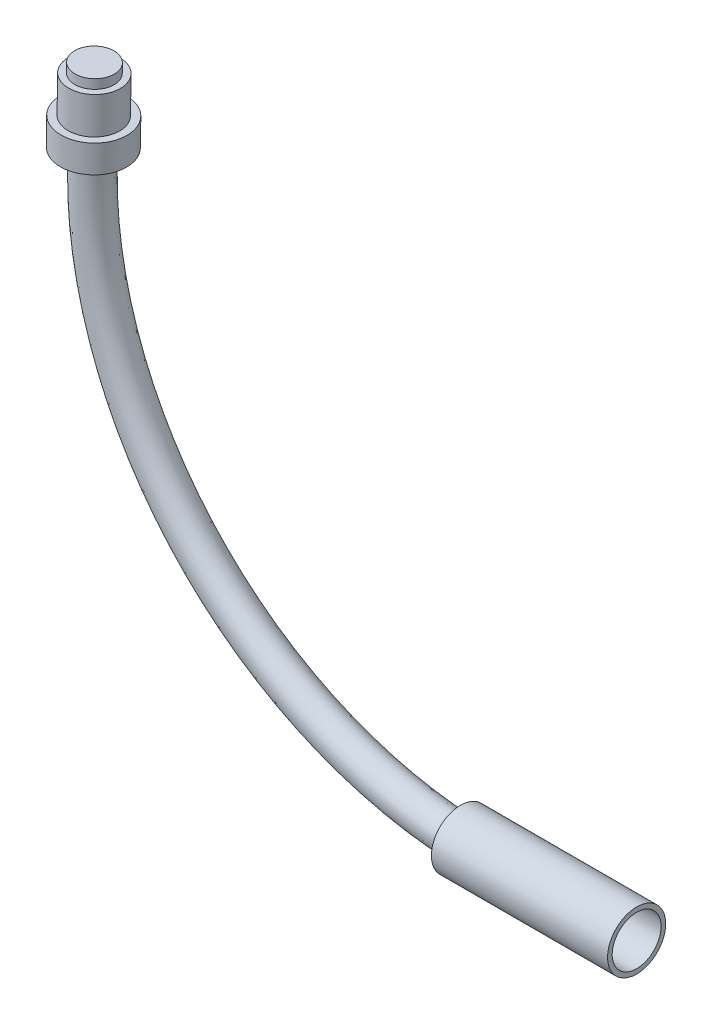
ISO-10303-21;
HEADER;
FILE_DESCRIPTION(('STEP AP214'),'2;1');
FILE_NAME('part.step','',(''),(''),'','','');
FILE_SCHEMA(('AUTOMOTIVE_DESIGN { 1 0 10303 214 1 1 1 1 }'));
ENDSEC;
DATA;
#1=APPLICATION_CONTEXT('core data for automotive mechanical design processes');
#2=APPLICATION_PROTOCOL_DEFINITION('international standard','automotive_design',2000,#1);
#3=PRODUCT_CONTEXT('',#1,'mechanical');
#4=PRODUCT('Part','Part','',(#3));
#5=PRODUCT_RELATED_PRODUCT_CATEGORY('part','',(#4));
#6=PRODUCT_DEFINITION_FORMATION('','',#4);
#7=PRODUCT_DEFINITION_CONTEXT('part definition',#1,'design');
#8=PRODUCT_DEFINITION('design','',#6,#7);
#9=PRODUCT_DEFINITION_SHAPE('','',#8);
#10=(LENGTH_UNIT() NAMED_UNIT(*) SI_UNIT(.MILLI.,.METRE.));
#11=(NAMED_UNIT(*) PLANE_ANGLE_UNIT() SI_UNIT($,.RADIAN.));
#12=(NAMED_UNIT(*) SI_UNIT($,.STERADIAN.) SOLID_ANGLE_UNIT());
#13=UNCERTAINTY_MEASURE_WITH_UNIT(LENGTH_MEASURE(1.E-05),#10,'distance_accuracy_value','');
#14=(GEOMETRIC_REPRESENTATION_CONTEXT(3) GLOBAL_UNCERTAINTY_ASSIGNED_CONTEXT((#13)) GLOBAL_UNIT_ASSIGNED_CONTEXT((#10,
#11,#12)) REPRESENTATION_CONTEXT('',''));
#15=CARTESIAN_POINT('',(0.,0.,0.));
#16=DIRECTION('',(0.,0.,1.));
#17=DIRECTION('',(1.,0.,0.));
#18=AXIS2_PLACEMENT_3D('',#15,#16,#17);
#19=CARTESIAN_POINT('',(-50.3085181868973,323.403177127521,-0.000182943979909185));
#20=DIRECTION('',(0.0161457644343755,0.999869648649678,0.));
#21=DIRECTION('',(-0.999869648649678,0.0161457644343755,0.));
#22=AXIS2_PLACEMENT_3D('',#19,#20,#21);
#23=PLANE('',#22);
#24=CARTESIAN_POINT('',(-50.3085181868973,323.403177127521,-0.000182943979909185));
#25=DIRECTION('',(0.0161457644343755,0.999869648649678,0.));
#26=DIRECTION('',(-0.999869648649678,0.0161457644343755,0.));
#27=AXIS2_PLACEMENT_3D('',#24,#25,#26);
#28=CIRCLE('',#27,2.6893471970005);
#29=CARTESIAN_POINT('',(-52.9975148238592,323.446598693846,-0.000182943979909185));
#30=VERTEX_POINT('',#29);
#31=EDGE_CURVE('E56',#30,#30,#28,.T.);
#32=ORIENTED_EDGE('',*,*,#31,.T.);
#33=EDGE_LOOP('',(#32));
#34=FACE_BOUND('',#33,.T.);
#35=CARTESIAN_POINT('',(-50.3085181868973,323.403177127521,-0.000182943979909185));
#36=DIRECTION('',(0.0161457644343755,0.999869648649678,0.));
#37=DIRECTION('',(-0.999869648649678,0.0161457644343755,0.));
#38=AXIS2_PLACEMENT_3D('',#35,#36,#37);
#39=CIRCLE('',#38,2.0447572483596);
#40=CARTESIAN_POINT('',(-52.3530088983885,323.436191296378,-0.000182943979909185));
#41=VERTEX_POINT('',#40);
#42=EDGE_CURVE('E65',#41,#41,#39,.T.);
#43=ORIENTED_EDGE('',*,*,#42,.F.);
#44=EDGE_LOOP('',(#43));
#45=FACE_BOUND('',#44,.T.);
#46=ADVANCED_FACE('F30',(#34,#45),#23,.T.);
#47=CARTESIAN_POINT('',(-50.3705179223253,319.563677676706,-0.000182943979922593));
#48=DIRECTION('',(0.0161457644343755,0.999869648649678,0.));
#49=DIRECTION('',(-0.999869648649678,0.0161457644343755,0.));
#50=AXIS2_PLACEMENT_3D('',#47,#48,#49);
#51=PLANE('',#50);
#52=CARTESIAN_POINT('',(-50.3705179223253,319.563677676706,-0.000182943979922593));
#53=DIRECTION('',(0.0161457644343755,0.999869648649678,0.));
#54=DIRECTION('',(-0.999869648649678,0.0161457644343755,0.));
#55=AXIS2_PLACEMENT_3D('',#52,#53,#54);
#56=CIRCLE('',#55,3.44746331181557);
#57=CARTESIAN_POINT('',(-53.817531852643,319.619339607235,-0.000182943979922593));
#58=VERTEX_POINT('',#57);
#59=EDGE_CURVE('E50',#58,#58,#56,.T.);
#60=ORIENTED_EDGE('',*,*,#59,.T.);
#61=EDGE_LOOP('',(#60));
#62=FACE_BOUND('',#61,.T.);
#63=CARTESIAN_POINT('',(-50.3705179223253,319.563677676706,-0.000182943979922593));
#64=DIRECTION('',(0.0161457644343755,0.999869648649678,0.));
#65=DIRECTION('',(-0.999869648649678,0.0161457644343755,0.));
#66=AXIS2_PLACEMENT_3D('',#63,#64,#65);
#67=CIRCLE('',#66,2.6893471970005);
#68=CARTESIAN_POINT('',(-53.0595145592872,319.607099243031,-0.000182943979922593));
#69=VERTEX_POINT('',#68);
#70=EDGE_CURVE('E59',#69,#69,#67,.T.);
#71=ORIENTED_EDGE('',*,*,#70,.F.);
#72=EDGE_LOOP('',(#71));
#73=FACE_BOUND('',#72,.T.);
#74=ADVANCED_FACE('F122',(#62,#73),#51,.T.);
#75=CARTESIAN_POINT('',(-50.4170177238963,316.684053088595,-0.000182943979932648));
#76=DIRECTION('',(-0.0161457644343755,-0.999869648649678,0.));
#77=DIRECTION('',(0.,0.,-1.));
#78=AXIS2_PLACEMENT_3D('',#75,#76,#77);
#79=CIRCLE('',#78,1.8170285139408);
#80=CARTESIAN_POINT('',(-10.2628615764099,313.889772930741,-0.000182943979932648));
#81=DIRECTION('',(0.,0.,1.));
#82=AXIS1_PLACEMENT('',#80,#81);
#83=SURFACE_OF_REVOLUTION('',#79,#82);
#84=CARTESIAN_POINT('',(-50.4170177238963,316.684053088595,-0.000182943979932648));
#85=DIRECTION('',(-0.0161457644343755,-0.999869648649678,0.));
#86=DIRECTION('',(0.,0.,-1.));
#87=AXIS2_PLACEMENT_3D('',#84,#85,#86);
#88=CIRCLE('',#87,1.8170285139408);
#89=CARTESIAN_POINT('',(-50.4170177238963,316.684053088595,-1.81721145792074));
#90=VERTEX_POINT('',#89);
#91=EDGE_CURVE('E47',#90,#90,#88,.T.);
#92=ORIENTED_EDGE('',*,*,#91,.T.);
#93=EDGE_LOOP('',(#92));
#94=FACE_BOUND('',#93,.T.);
#95=CARTESIAN_POINT('',(-12.4084579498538,273.695735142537,-0.000182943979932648));
#96=DIRECTION('',(1.,0.,0.));
#97=DIRECTION('',(0.,0.,-1.));
#98=AXIS2_PLACEMENT_3D('',#95,#96,#97);
#99=CIRCLE('',#98,1.8170285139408);
#100=CARTESIAN_POINT('',(-12.4084579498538,273.695735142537,-1.81721145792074));
#101=VERTEX_POINT('',#100);
#102=EDGE_CURVE('E10',#101,#101,#99,.T.);
#103=ORIENTED_EDGE('',*,*,#102,.F.);
#104=EDGE_LOOP('',(#103));
#105=FACE_BOUND('',#104,.T.);
#106=ADVANCED_FACE('F32',(#94,#105),#83,.F.);
#107=CARTESIAN_POINT('',(5.83154205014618,273.695735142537,-0.000182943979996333));
#108=DIRECTION('',(-1.,0.,0.));
#109=DIRECTION('',(0.,0.,1.));
#110=AXIS2_PLACEMENT_3D('',#107,#108,#109);
#111=CYLINDRICAL_SURFACE('',#110,3.01097120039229);
#112=CARTESIAN_POINT('',(5.83154205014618,273.695735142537,-0.000182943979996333));
#113=DIRECTION('',(1.,0.,0.));
#114=DIRECTION('',(0.,0.,-1.));
#115=AXIS2_PLACEMENT_3D('',#112,#113,#114);
#116=CIRCLE('',#115,3.01097120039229);
#117=CARTESIAN_POINT('',(5.83154205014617,273.695735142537,-3.01115414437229));
#118=VERTEX_POINT('',#117);
#119=EDGE_CURVE('E38',#118,#118,#116,.T.);
#120=ORIENTED_EDGE('',*,*,#119,.F.);
#121=EDGE_LOOP('',(#120));
#122=FACE_BOUND('',#121,.T.);
#123=CARTESIAN_POINT('',(-12.4084579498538,273.695735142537,-0.000182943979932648));
#124=DIRECTION('',(1.,0.,0.));
#125=DIRECTION('',(0.,0.,-1.));
#126=AXIS2_PLACEMENT_3D('',#123,#124,#125);
#127=CIRCLE('',#126,3.01097120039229);
#128=CARTESIAN_POINT('',(-12.4084579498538,273.695735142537,-3.01115414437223));
#129=VERTEX_POINT('',#128);
#130=EDGE_CURVE('E42',#129,#129,#127,.T.);
#131=ORIENTED_EDGE('',*,*,#130,.T.);
#132=EDGE_LOOP('',(#131));
#133=FACE_BOUND('',#132,.T.);
#134=ADVANCED_FACE('F152',(#122,#133),#111,.T.);
#135=CARTESIAN_POINT('',(5.83154205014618,273.695735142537,-0.000182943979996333));
#136=DIRECTION('',(1.,0.,0.));
#137=DIRECTION('',(0.,0.,-1.));
#138=AXIS2_PLACEMENT_3D('',#135,#136,#137);
#139=PLANE('',#138);
#140=CARTESIAN_POINT('',(5.83154205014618,273.695735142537,-0.000182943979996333));
#141=DIRECTION('',(1.,0.,0.));
#142=DIRECTION('',(0.,0.,-1.));
#143=AXIS2_PLACEMENT_3D('',#140,#141,#142);
#144=CIRCLE('',#143,2.53097120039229);
#145=CARTESIAN_POINT('',(5.83154205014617,273.695735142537,-2.53115414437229));
#146=VERTEX_POINT('',#145);
#147=EDGE_CURVE('E69',#146,#146,#144,.T.);
#148=ORIENTED_EDGE('',*,*,#147,.F.);
#149=EDGE_LOOP('',(#148));
#150=FACE_BOUND('',#149,.T.);
#151=ORIENTED_EDGE('',*,*,#119,.T.);
#152=EDGE_LOOP('',(#151));
#153=FACE_BOUND('',#152,.T.);
#154=ADVANCED_FACE('F150',(#150,#153),#139,.T.);
#155=CARTESIAN_POINT('',(-12.4084579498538,273.695735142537,-0.000182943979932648));
#156=DIRECTION('',(1.,0.,0.));
#157=DIRECTION('',(0.,0.,-1.));
#158=AXIS2_PLACEMENT_3D('',#155,#156,#157);
#159=PLANE('',#158);
#160=ORIENTED_EDGE('',*,*,#102,.T.);
#161=EDGE_LOOP('',(#160));
#162=FACE_BOUND('',#161,.T.);
#163=ORIENTED_EDGE('',*,*,#130,.F.);
#164=EDGE_LOOP('',(#163));
#165=FACE_BOUND('',#164,.T.);
#166=ADVANCED_FACE('F146',(#162,#165),#159,.F.);
#167=CARTESIAN_POINT('',(-50.3705179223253,319.563677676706,-0.000182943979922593));
#168=DIRECTION('',(-0.0161457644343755,-0.999869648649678,0.));
#169=DIRECTION('',(0.999869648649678,-0.0161457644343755,0.));
#170=AXIS2_PLACEMENT_3D('',#167,#168,#169);
#171=CYLINDRICAL_SURFACE('',#170,3.44746331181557);
#172=ORIENTED_EDGE('',*,*,#59,.F.);
#173=EDGE_LOOP('',(#172));
#174=FACE_BOUND('',#173,.T.);
#175=CARTESIAN_POINT('',(-50.4170177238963,316.684053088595,-0.000182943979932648));
#176=DIRECTION('',(0.0161457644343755,0.999869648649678,0.));
#177=DIRECTION('',(-0.999869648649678,0.0161457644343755,0.));
#178=AXIS2_PLACEMENT_3D('',#175,#176,#177);
#179=CIRCLE('',#178,3.44746331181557);
#180=CARTESIAN_POINT('',(-53.864031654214,316.739715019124,-0.000182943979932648));
#181=VERTEX_POINT('',#180);
#182=EDGE_CURVE('E53',#181,#181,#179,.T.);
#183=ORIENTED_EDGE('',*,*,#182,.T.);
#184=EDGE_LOOP('',(#183));
#185=FACE_BOUND('',#184,.T.);
#186=ADVANCED_FACE('F141',(#174,#185),#171,.T.);
#187=CARTESIAN_POINT('',(-50.4170177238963,316.684053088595,-0.000182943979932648));
#188=DIRECTION('',(0.0161457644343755,0.999869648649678,0.));
#189=DIRECTION('',(-0.999869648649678,0.0161457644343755,0.));
#190=AXIS2_PLACEMENT_3D('',#187,#188,#189);
#191=PLANE('',#190);
#192=ORIENTED_EDGE('',*,*,#91,.F.);
#193=EDGE_LOOP('',(#192));
#194=FACE_BOUND('',#193,.T.);
#195=ORIENTED_EDGE('',*,*,#182,.F.);
#196=EDGE_LOOP('',(#195));
#197=FACE_BOUND('',#196,.T.);
#198=ADVANCED_FACE('F138',(#194,#197),#191,.F.);
#199=CARTESIAN_POINT('',(-50.3085181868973,323.403177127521,-0.000182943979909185));
#200=DIRECTION('',(-0.0161457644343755,-0.999869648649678,0.));
#201=DIRECTION('',(0.999869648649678,-0.0161457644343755,0.));
#202=AXIS2_PLACEMENT_3D('',#199,#200,#201);
#203=CYLINDRICAL_SURFACE('',#202,2.6893471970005);
#204=ORIENTED_EDGE('',*,*,#31,.F.);
#205=EDGE_LOOP('',(#204));
#206=FACE_BOUND('',#205,.T.);
#207=ORIENTED_EDGE('',*,*,#70,.T.);
#208=EDGE_LOOP('',(#207));
#209=FACE_BOUND('',#208,.T.);
#210=ADVANCED_FACE('F135',(#206,#209),#203,.T.);
#211=CARTESIAN_POINT('',(-50.2930182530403,324.363051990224,-0.000182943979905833));
#212=DIRECTION('',(-0.0161457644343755,-0.999869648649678,0.));
#213=DIRECTION('',(0.999869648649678,-0.0161457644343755,0.));
#214=AXIS2_PLACEMENT_3D('',#211,#212,#213);
#215=CYLINDRICAL_SURFACE('',#214,2.0447572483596);
#216=CARTESIAN_POINT('',(-50.2930182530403,324.363051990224,-0.000182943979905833));
#217=DIRECTION('',(0.0161457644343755,0.999869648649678,0.));
#218=DIRECTION('',(-0.999869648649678,0.0161457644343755,0.));
#219=AXIS2_PLACEMENT_3D('',#216,#217,#218);
#220=CIRCLE('',#219,2.0447572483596);
#221=CARTESIAN_POINT('',(-52.3375089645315,324.396066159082,-0.000182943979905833));
#222=VERTEX_POINT('',#221);
#223=EDGE_CURVE('E62',#222,#222,#220,.T.);
#224=ORIENTED_EDGE('',*,*,#223,.F.);
#225=EDGE_LOOP('',(#224));
#226=FACE_BOUND('',#225,.T.);
#227=ORIENTED_EDGE('',*,*,#42,.T.);
#228=EDGE_LOOP('',(#227));
#229=FACE_BOUND('',#228,.T.);
#230=ADVANCED_FACE('F133',(#226,#229),#215,.T.);
#231=CARTESIAN_POINT('',(-50.2930182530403,324.363051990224,-0.000182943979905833));
#232=DIRECTION('',(0.0161457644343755,0.999869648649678,0.));
#233=DIRECTION('',(-0.999869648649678,0.0161457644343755,0.));
#234=AXIS2_PLACEMENT_3D('',#231,#232,#233);
#235=PLANE('',#234);
#236=ORIENTED_EDGE('',*,*,#223,.T.);
#237=EDGE_LOOP('',(#236));
#238=FACE_BOUND('',#237,.T.);
#239=ADVANCED_FACE('F195',(#238),#235,.T.);
#240=CARTESIAN_POINT('',(-50.3162681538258,322.923239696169,-0.000182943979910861));
#241=DIRECTION('',(0.0161457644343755,0.999869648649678,0.));
#242=DIRECTION('',(-0.999869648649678,0.0161457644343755,0.));
#243=AXIS2_PLACEMENT_3D('',#240,#241,#242);
#244=PLANE('',#243);
#245=CARTESIAN_POINT('',(-50.3162681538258,322.923239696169,-0.000182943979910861));
#246=DIRECTION('',(0.0161457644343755,0.999869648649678,0.));
#247=DIRECTION('',(-0.999869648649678,0.0161457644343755,0.));
#248=AXIS2_PLACEMENT_3D('',#245,#246,#247);
#249=CIRCLE('',#248,2.2093471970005);
#250=CARTESIAN_POINT('',(-52.5253273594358,322.958911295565,-0.000182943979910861));
#251=VERTEX_POINT('',#250);
#252=EDGE_CURVE('E282',#251,#251,#249,.T.);
#253=ORIENTED_EDGE('',*,*,#252,.F.);
#254=EDGE_LOOP('',(#253));
#255=FACE_BOUND('',#254,.T.);
#256=CARTESIAN_POINT('',(-50.3162681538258,322.923239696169,-0.000182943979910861));
#257=DIRECTION('',(0.0161457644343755,0.999869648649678,0.));
#258=DIRECTION('',(-0.999869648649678,0.0161457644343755,0.));
#259=AXIS2_PLACEMENT_3D('',#256,#257,#258);
#260=CIRCLE('',#259,1.5647572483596);
#261=CARTESIAN_POINT('',(-51.8808214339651,322.948503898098,-0.000182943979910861));
#262=VERTEX_POINT('',#261);
#263=EDGE_CURVE('E77',#262,#262,#260,.T.);
#264=ORIENTED_EDGE('',*,*,#263,.T.);
#265=EDGE_LOOP('',(#264));
#266=FACE_BOUND('',#265,.T.);
#267=ADVANCED_FACE('F203',(#255,#266),#244,.F.);
#268=CARTESIAN_POINT('',(-50.3782678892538,319.083740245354,-0.000182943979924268));
#269=DIRECTION('',(0.0161457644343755,0.999869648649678,0.));
#270=DIRECTION('',(-0.999869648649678,0.0161457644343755,0.));
#271=AXIS2_PLACEMENT_3D('',#268,#269,#270);
#272=PLANE('',#271);
#273=CARTESIAN_POINT('',(-50.3782678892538,319.083740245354,-0.000182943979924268));
#274=DIRECTION('',(0.0161457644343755,0.999869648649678,0.));
#275=DIRECTION('',(-0.999869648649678,0.0161457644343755,0.));
#276=AXIS2_PLACEMENT_3D('',#273,#274,#275);
#277=CIRCLE('',#276,2.96746331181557);
#278=CARTESIAN_POINT('',(-53.3453443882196,319.131652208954,-0.000182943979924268));
#279=VERTEX_POINT('',#278);
#280=EDGE_CURVE('E285',#279,#279,#277,.T.);
#281=ORIENTED_EDGE('',*,*,#280,.F.);
#282=EDGE_LOOP('',(#281));
#283=FACE_BOUND('',#282,.T.);
#284=CARTESIAN_POINT('',(-50.3782678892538,319.083740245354,-0.000182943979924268));
#285=DIRECTION('',(0.0161457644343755,0.999869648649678,0.));
#286=DIRECTION('',(-0.999869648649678,0.0161457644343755,0.));
#287=AXIS2_PLACEMENT_3D('',#284,#285,#286);
#288=CIRCLE('',#287,2.2093471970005);
#289=CARTESIAN_POINT('',(-52.5873270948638,319.119411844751,-0.000182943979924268));
#290=VERTEX_POINT('',#289);
#291=EDGE_CURVE('E76',#290,#290,#288,.T.);
#292=ORIENTED_EDGE('',*,*,#291,.T.);
#293=EDGE_LOOP('',(#292));
#294=FACE_BOUND('',#293,.T.);
#295=ADVANCED_FACE('F99',(#283,#294),#272,.F.);
#296=CARTESIAN_POINT('',(-50.4170177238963,316.684053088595,-0.000182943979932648));
#297=DIRECTION('',(-0.0161457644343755,-0.999869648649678,0.));
#298=DIRECTION('',(0.,0.,-1.));
#299=AXIS2_PLACEMENT_3D('',#296,#297,#298);
#300=CIRCLE('',#299,1.8170285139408);
#301=CARTESIAN_POINT('',(-10.2628615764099,313.889772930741,-0.000182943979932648));
#302=DIRECTION('',(0.,0.,1.));
#303=AXIS1_PLACEMENT('',#301,#302);
#304=SURFACE_OF_REVOLUTION('',#300,#303);
#305=OFFSET_SURFACE('',#304,0.48,.F.);
#306=CARTESIAN_POINT('',(-50.4017398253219,317.16386895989,1.3366811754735));
#307=CARTESIAN_POINT('',(-50.4768591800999,317.165081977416,1.33549800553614));
#308=CARTESIAN_POINT('',(-50.5519573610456,317.166294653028,1.32796339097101));
#309=CARTESIAN_POINT('',(-50.6627834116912,317.168084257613,1.30731394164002));
#310=CARTESIAN_POINT('',(-50.6994513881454,317.168676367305,1.29886202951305));
#311=CARTESIAN_POINT('',(-50.7719818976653,317.169847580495,1.27889376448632));
#312=CARTESIAN_POINT('',(-50.8078436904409,317.170426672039,1.26737471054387));
#313=CARTESIAN_POINT('',(-50.9136861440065,317.172135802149,1.22836513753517));
#314=CARTESIAN_POINT('',(-50.9820690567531,317.173240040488,1.19639499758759));
#315=CARTESIAN_POINT('',(-51.1124895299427,317.175346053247,1.12141132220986));
#316=CARTESIAN_POINT('',(-51.1745269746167,317.176347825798,1.07839758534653));
#317=CARTESIAN_POINT('',(-51.2614763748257,317.177751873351,1.00656697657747));
#318=CARTESIAN_POINT('',(-51.2894573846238,317.178203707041,0.981386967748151));
#319=CARTESIAN_POINT('',(-51.343174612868,317.179071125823,0.928786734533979));
#320=CARTESIAN_POINT('',(-51.368912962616,317.179486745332,0.901368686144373));
#321=CARTESIAN_POINT('',(-51.4425355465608,317.180675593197,0.815979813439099));
#322=CARTESIAN_POINT('',(-51.4868490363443,317.18139116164,0.754856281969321));
#323=CARTESIAN_POINT('',(-51.5645497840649,317.182645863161,0.626079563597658));
#324=CARTESIAN_POINT('',(-51.5979394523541,317.183185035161,0.558427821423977));
#325=CARTESIAN_POINT('',(-51.6528924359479,317.18407240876,0.418469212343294));
#326=CARTESIAN_POINT('',(-51.6744557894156,317.184420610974,0.346162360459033));
#327=CARTESIAN_POINT('',(-51.7051304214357,317.184915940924,0.198970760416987));
#328=CARTESIAN_POINT('',(-51.7142441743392,317.185063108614,0.124086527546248));
#329=CARTESIAN_POINT('',(-51.7197710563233,317.185152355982,-0.0261497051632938));
#330=CARTESIAN_POINT('',(-51.7161842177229,317.185094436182,-0.101501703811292));
#331=CARTESIAN_POINT('',(-51.6964122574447,317.184775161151,-0.250526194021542));
#332=CARTESIAN_POINT('',(-51.6802283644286,317.184513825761,-0.324198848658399));
#333=CARTESIAN_POINT('',(-51.635723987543,317.183795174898,-0.467781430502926));
#334=CARTESIAN_POINT('',(-51.6074034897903,317.183337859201,-0.53769135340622));
#335=CARTESIAN_POINT('',(-51.539428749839,317.182240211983,-0.671768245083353));
#336=CARTESIAN_POINT('',(-51.4997738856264,317.181599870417,-0.735934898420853));
#337=CARTESIAN_POINT('',(-51.4102575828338,317.180154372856,-0.856700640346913));
#338=CARTESIAN_POINT('',(-51.3603961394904,317.179349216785,-0.913299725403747));
#339=CARTESIAN_POINT('',(-51.2518726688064,317.177596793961,-1.01733475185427));
#340=CARTESIAN_POINT('',(-51.193209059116,317.176649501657,-1.06476904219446));
#341=CARTESIAN_POINT('',(-51.0687533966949,317.174639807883,-1.14911681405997));
#342=CARTESIAN_POINT('',(-51.0029613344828,317.173577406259,-1.18603028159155));
#343=CARTESIAN_POINT('',(-50.866101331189,317.171367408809,-1.24829665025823));
#344=CARTESIAN_POINT('',(-50.7950322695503,317.170219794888,-1.27364708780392));
#345=CARTESIAN_POINT('',(-50.6496477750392,317.167872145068,-1.31205704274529));
#346=CARTESIAN_POINT('',(-50.5753323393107,317.166672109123,-1.32511654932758));
#347=CARTESIAN_POINT('',(-50.4255533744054,317.164253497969,-1.33857522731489));
#348=CARTESIAN_POINT('',(-50.3500896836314,317.163034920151,-1.33897259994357));
#349=CARTESIAN_POINT('',(-50.2001666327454,317.160613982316,-1.32709095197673));
#350=CARTESIAN_POINT('',(-50.1257072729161,317.159411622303,-1.31481192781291));
#351=CARTESIAN_POINT('',(-49.9799059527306,317.157057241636,-1.27792526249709));
#352=CARTESIAN_POINT('',(-49.9085640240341,317.155905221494,-1.25331749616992));
#353=CARTESIAN_POINT('',(-49.7710242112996,317.15368424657,-1.19247106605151));
#354=CARTESIAN_POINT('',(-49.7048263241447,317.152615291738,-1.15623240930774));
#355=CARTESIAN_POINT('',(-49.5794619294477,317.150590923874,-1.07315696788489));
#356=CARTESIAN_POINT('',(-49.5202946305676,317.149635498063,-1.02632137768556));
#357=CARTESIAN_POINT('',(-49.4106635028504,317.147865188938,-0.923378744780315));
#358=CARTESIAN_POINT('',(-49.3601996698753,317.147050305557,-0.867271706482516));
#359=CARTESIAN_POINT('',(-49.2694172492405,317.145584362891,-0.747389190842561));
#360=CARTESIAN_POINT('',(-49.2290969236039,317.144933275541,-0.683615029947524));
#361=CARTESIAN_POINT('',(-49.1597358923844,317.143813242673,-0.550201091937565));
#362=CARTESIAN_POINT('',(-49.1306951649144,317.1433442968,-0.480561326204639));
#363=CARTESIAN_POINT('',(-49.0847223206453,317.142601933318,-0.337404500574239));
#364=CARTESIAN_POINT('',(-49.0677883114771,317.142328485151,-0.263888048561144));
#365=CARTESIAN_POINT('',(-49.0465021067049,317.141984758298,-0.115055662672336));
#366=CARTESIAN_POINT('',(-49.0421499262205,317.141914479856,-0.0397397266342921));
#367=CARTESIAN_POINT('',(-49.0461530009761,317.141979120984,0.110549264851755));
#368=CARTESIAN_POINT('',(-49.054507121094,317.142114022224,0.185522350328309));
#369=CARTESIAN_POINT('',(-49.0836756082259,317.142585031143,0.332993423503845));
#370=CARTESIAN_POINT('',(-49.104489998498,317.142921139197,0.405491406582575));
#371=CARTESIAN_POINT('',(-49.1580172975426,317.143785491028,0.545996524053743));
#372=CARTESIAN_POINT('',(-49.1907304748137,317.14431373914,0.614003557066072));
#373=CARTESIAN_POINT('',(-49.2479531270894,317.145237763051,0.711095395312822));
#374=CARTESIAN_POINT('',(-49.26839068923,317.145567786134,0.742644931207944));
#375=CARTESIAN_POINT('',(-49.3118667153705,317.146269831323,0.803944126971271));
#376=CARTESIAN_POINT('',(-49.3349076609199,317.146641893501,0.83369202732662));
#377=CARTESIAN_POINT('',(-49.407647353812,317.147816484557,0.919823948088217));
#378=CARTESIAN_POINT('',(-49.4610111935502,317.148678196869,0.973177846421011));
#379=CARTESIAN_POINT('',(-49.575944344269,317.150534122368,1.0701553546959));
#380=CARTESIAN_POINT('',(-49.6375135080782,317.15152833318,1.11377913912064));
#381=CARTESIAN_POINT('',(-49.7346786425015,317.153097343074,1.17100336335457));
#382=CARTESIAN_POINT('',(-49.7679063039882,317.15363389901,1.188723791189));
#383=CARTESIAN_POINT('',(-49.8357020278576,317.1547286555,1.22128879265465));
#384=CARTESIAN_POINT('',(-49.8702688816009,317.155286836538,1.23613589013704));
#385=CARTESIAN_POINT('',(-49.9756162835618,317.156987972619,1.27619453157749));
#386=CARTESIAN_POINT('',(-50.0481519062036,317.158159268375,1.296987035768));
#387=CARTESIAN_POINT('',(-50.1678953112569,317.160092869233,1.32062991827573));
#388=CARTESIAN_POINT('',(-50.2144010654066,317.160843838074,1.32728461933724));
#389=CARTESIAN_POINT('',(-50.3078539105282,317.162352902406,1.33567990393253));
#390=CARTESIAN_POINT('',(-50.3548010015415,317.163110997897,1.33742048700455));
#391=CARTESIAN_POINT('',(-50.4017398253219,317.16386895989,1.3366811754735));
#392=B_SPLINE_CURVE_WITH_KNOTS('',3,(#306,#307,#308,#309,#310,#311,#312,#313,#314,#315,#316,
#317,#318,#319,#320,#321,#322,#323,#324,#325,#326,#327,#328,#329,#330,#331,#332,#333,#334,#335,
#336,#337,#338,#339,#340,#341,#342,#343,#344,#345,#346,#347,#348,#349,#350,#351,#352,#353,#354,
#355,#356,#357,#358,#359,#360,#361,#362,#363,#364,#365,#366,#367,#368,#369,#370,#371,#372,#373,
#374,#375,#376,#377,#378,#379,#380,#381,#382,#383,#384,#385,#386,#387,#388,#389,#390,#391),
.UNSPECIFIED.,.T.,.F.,(4,2,2,2,2,2,2,2,2,2,2,2,2,2,2,2,2,2,2,2,2,2,2,2,2,2,2,2,2,2,2,2,2,2,2,2,
2,2,2,2,2,2,4),(0.,0.225214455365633,0.33800794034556,0.450901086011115,0.676249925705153,
0.901602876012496,1.01442133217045,1.12713137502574,1.35246793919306,1.57775474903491,
1.80304083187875,2.02828213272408,2.25352286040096,2.47874162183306,2.70396064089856,
2.92919202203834,3.15442350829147,3.37969553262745,3.60496785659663,3.83028815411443,
4.05560864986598,4.28096115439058,4.50631372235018,4.73166857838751,4.95702329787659,
5.18235262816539,5.40768185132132,5.63297244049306,5.85826259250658,6.08351752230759,
6.30877272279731,6.53400780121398,6.75924330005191,6.98448388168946,7.09714581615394,
7.20991606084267,7.43517567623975,7.6604312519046,7.77329604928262,7.88606125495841,
8.11121963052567,8.25194635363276,8.39267308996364),.UNSPECIFIED.);
#393=CARTESIAN_POINT('',(-50.4017398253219,317.16386895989,1.3366811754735));
#394=VERTEX_POINT('',#393);
#395=EDGE_CURVE('E80',#394,#394,#392,.T.);
#396=ORIENTED_EDGE('',*,*,#395,.F.);
#397=EDGE_LOOP('',(#396));
#398=FACE_BOUND('',#397,.T.);
#399=CARTESIAN_POINT('',(-11.9284579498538,273.689714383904,1.33674067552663));
#400=CARTESIAN_POINT('',(-11.9284579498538,273.614746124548,1.33767565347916));
#401=CARTESIAN_POINT('',(-11.9284579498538,273.539620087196,1.33227257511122));
#402=CARTESIAN_POINT('',(-11.9284579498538,273.428485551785,1.31479111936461));
#403=CARTESIAN_POINT('',(-11.9284579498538,273.391670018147,1.30739115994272));
#404=CARTESIAN_POINT('',(-11.9284579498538,273.31875652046,1.28951185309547));
#405=CARTESIAN_POINT('',(-11.9284579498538,273.28265921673,1.27902980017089));
#406=CARTESIAN_POINT('',(-11.9284579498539,273.175982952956,1.24309495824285));
#407=CARTESIAN_POINT('',(-11.9284579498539,273.106871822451,1.2131300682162));
#408=CARTESIAN_POINT('',(-11.9284579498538,272.974664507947,1.14201410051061));
#409=CARTESIAN_POINT('',(-11.9284579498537,272.911568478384,1.10086273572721));
#410=CARTESIAN_POINT('',(-11.9284579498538,272.822784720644,1.03166740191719));
#411=CARTESIAN_POINT('',(-11.9284579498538,272.794143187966,1.00733172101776));
#412=CARTESIAN_POINT('',(-11.9284579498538,272.739035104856,0.956363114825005));
#413=CARTESIAN_POINT('',(-11.9284579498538,272.712566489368,0.929732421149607));
#414=CARTESIAN_POINT('',(-11.9284579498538,272.636652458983,0.846613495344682));
#415=CARTESIAN_POINT('',(-11.9284579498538,272.590677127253,0.78688144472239));
#416=CARTESIAN_POINT('',(-11.9284579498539,272.509377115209,0.660525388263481));
#417=CARTESIAN_POINT('',(-11.9284579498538,272.474062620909,0.593894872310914));
#418=CARTESIAN_POINT('',(-11.9284579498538,272.415103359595,0.45564646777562));
#419=CARTESIAN_POINT('',(-11.9284579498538,272.391458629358,0.38402856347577));
#420=CARTESIAN_POINT('',(-11.9284579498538,272.356500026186,0.23778064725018));
#421=CARTESIAN_POINT('',(-11.9284579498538,272.345196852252,0.163148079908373));
#422=CARTESIAN_POINT('',(-11.9284579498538,272.335274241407,0.0130439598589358));
#423=CARTESIAN_POINT('',(-11.9284579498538,272.336654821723,-0.0624275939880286));
#424=CARTESIAN_POINT('',(-11.9284579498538,272.352064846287,-0.212100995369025));
#425=CARTESIAN_POINT('',(-11.9284579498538,272.366099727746,-0.28630228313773));
#426=CARTESIAN_POINT('',(-11.9284579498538,272.406429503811,-0.431295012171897));
#427=CARTESIAN_POINT('',(-11.9284579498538,272.432724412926,-0.502086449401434));
#428=CARTESIAN_POINT('',(-11.9284579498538,272.496825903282,-0.638236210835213));
#429=CARTESIAN_POINT('',(-11.9284579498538,272.53463062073,-0.703595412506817));
#430=CARTESIAN_POINT('',(-11.9284579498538,272.620683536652,-0.827033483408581));
#431=CARTESIAN_POINT('',(-11.9284579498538,272.668931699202,-0.885112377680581));
#432=CARTESIAN_POINT('',(-11.9284579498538,272.774467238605,-0.992296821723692));
#433=CARTESIAN_POINT('',(-11.9284579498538,272.8317483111,-1.04140857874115));
#434=CARTESIAN_POINT('',(-11.9284579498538,272.953749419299,-1.12930720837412));
#435=CARTESIAN_POINT('',(-11.9284579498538,273.018469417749,-1.16809413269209));
#436=CARTESIAN_POINT('',(-11.9284579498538,273.153443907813,-1.23420204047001));
#437=CARTESIAN_POINT('',(-11.9284579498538,273.223692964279,-1.26153412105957));
#438=CARTESIAN_POINT('',(-11.9284579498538,273.367785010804,-1.30400503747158));
#439=CARTESIAN_POINT('',(-11.9284579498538,273.441627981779,-1.31914393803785));
#440=CARTESIAN_POINT('',(-11.9284579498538,273.590743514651,-1.33678712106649));
#441=CARTESIAN_POINT('',(-11.9284579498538,273.666014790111,-1.33930227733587));
#442=CARTESIAN_POINT('',(-11.9284579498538,273.815910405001,-1.33165475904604));
#443=CARTESIAN_POINT('',(-11.9284579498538,273.890534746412,-1.32149212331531));
#444=CARTESIAN_POINT('',(-11.9284579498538,274.036989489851,-1.28878501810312));
#445=CARTESIAN_POINT('',(-11.9284579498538,274.108820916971,-1.26624513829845));
#446=CARTESIAN_POINT('',(-11.9284579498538,274.247681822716,-1.20942965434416));
#447=CARTESIAN_POINT('',(-11.9284579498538,274.314711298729,-1.17515404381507));
#448=CARTESIAN_POINT('',(-11.9284579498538,274.442091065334,-1.09583078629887));
#449=CARTESIAN_POINT('',(-11.9284579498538,274.502439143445,-1.05077958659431));
#450=CARTESIAN_POINT('',(-11.9284579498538,274.614724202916,-0.951193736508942));
#451=CARTESIAN_POINT('',(-11.9284579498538,274.666661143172,-0.896659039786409));
#452=CARTESIAN_POINT('',(-11.9284579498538,274.760702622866,-0.779600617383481));
#453=CARTESIAN_POINT('',(-11.9284579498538,274.802797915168,-0.717069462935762));
#454=CARTESIAN_POINT('',(-11.9284579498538,274.875906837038,-0.585833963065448));
#455=CARTESIAN_POINT('',(-11.9284579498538,274.906920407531,-0.517129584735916));
#456=CARTESIAN_POINT('',(-11.9284579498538,274.957021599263,-0.375414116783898));
#457=CARTESIAN_POINT('',(-11.9284579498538,274.976095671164,-0.302398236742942));
#458=CARTESIAN_POINT('',(-11.9284579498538,275.00172600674,-0.154201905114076));
#459=CARTESIAN_POINT('',(-11.9284579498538,275.008282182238,-0.0790214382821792));
#460=CARTESIAN_POINT('',(-11.9284579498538,275.008690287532,0.0714354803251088));
#461=CARTESIAN_POINT('',(-11.9284579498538,275.002532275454,0.146711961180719));
#462=CARTESIAN_POINT('',(-11.9284579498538,274.977672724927,0.295154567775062));
#463=CARTESIAN_POINT('',(-11.9284579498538,274.958971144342,0.368320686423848));
#464=CARTESIAN_POINT('',(-11.9284579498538,274.909522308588,0.510509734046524));
#465=CARTESIAN_POINT('',(-11.9284579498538,274.878774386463,0.579532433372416));
#466=CARTESIAN_POINT('',(-11.9284579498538,274.824340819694,0.678378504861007));
#467=CARTESIAN_POINT('',(-11.9284579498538,274.804806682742,0.710551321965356));
#468=CARTESIAN_POINT('',(-11.9284579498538,274.763079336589,0.773169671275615));
#469=CARTESIAN_POINT('',(-11.9284579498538,274.740883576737,0.8036135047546));
#470=CARTESIAN_POINT('',(-11.9284579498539,274.670618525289,0.891882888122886));
#471=CARTESIAN_POINT('',(-11.9284579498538,274.618795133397,0.94678459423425));
#472=CARTESIAN_POINT('',(-11.9284579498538,274.506649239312,1.04708172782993));
#473=CARTESIAN_POINT('',(-11.9284579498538,274.446326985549,1.09247743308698));
#474=CARTESIAN_POINT('',(-11.9284579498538,274.350827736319,1.15245538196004));
#475=CARTESIAN_POINT('',(-11.9284579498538,274.318144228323,1.17110141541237));
#476=CARTESIAN_POINT('',(-11.9284579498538,274.251354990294,1.20555683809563));
#477=CARTESIAN_POINT('',(-11.9284579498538,274.217250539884,1.22136871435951));
#478=CARTESIAN_POINT('',(-11.9284579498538,274.113163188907,1.26436857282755));
#479=CARTESIAN_POINT('',(-11.9284579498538,274.041299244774,1.28718788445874));
#480=CARTESIAN_POINT('',(-11.9284579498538,273.922438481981,1.31415671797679));
#481=CARTESIAN_POINT('',(-11.9284579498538,273.876252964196,1.32210005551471));
#482=CARTESIAN_POINT('',(-11.9284579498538,273.783303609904,1.33310003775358));
#483=CARTESIAN_POINT('',(-11.9284579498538,273.736539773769,1.33615668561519));
#484=CARTESIAN_POINT('',(-11.9284579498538,273.689714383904,1.33674067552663));
#485=B_SPLINE_CURVE_WITH_KNOTS('',3,(#399,#400,#401,#402,#403,#404,#405,#406,#407,#408,#409,
#410,#411,#412,#413,#414,#415,#416,#417,#418,#419,#420,#421,#422,#423,#424,#425,#426,#427,#428,
#429,#430,#431,#432,#433,#434,#435,#436,#437,#438,#439,#440,#441,#442,#443,#444,#445,#446,#447,
#448,#449,#450,#451,#452,#453,#454,#455,#456,#457,#458,#459,#460,#461,#462,#463,#464,#465,#466,
#467,#468,#469,#470,#471,#472,#473,#474,#475,#476,#477,#478,#479,#480,#481,#482,#483,#484),
.UNSPECIFIED.,.T.,.F.,(4,2,2,2,2,2,2,2,2,2,2,2,2,2,2,2,2,2,2,2,2,2,2,2,2,2,2,2,2,2,2,2,2,2,2,2,
2,2,2,2,2,2,4),(0.,0.22472172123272,0.337268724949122,0.449914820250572,0.674763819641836,
0.899618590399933,1.01225356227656,1.12478022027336,1.34975185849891,1.57493777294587,
1.80012439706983,2.02550608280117,2.25088807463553,2.4763669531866,2.70184609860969,
2.92728875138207,3.15273062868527,3.37801585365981,3.60329995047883,3.82836529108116,
4.05342943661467,4.27829968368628,4.50316924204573,4.72795547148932,4.95274182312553,
5.177602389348,5.40246405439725,5.62753615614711,5.85260945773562,6.0779377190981,
6.30326756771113,6.5287736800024,6.75428054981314,6.97979990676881,7.09260086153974,
7.20551079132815,7.43086293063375,7.65620848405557,7.76897387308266,7.88163981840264,
8.10659736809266,8.24695929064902,8.3873211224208),.UNSPECIFIED.);
#486=CARTESIAN_POINT('',(-11.9284579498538,273.689714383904,1.33674067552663));
#487=VERTEX_POINT('',#486);
#488=EDGE_CURVE('E68',#487,#487,#485,.T.);
#489=ORIENTED_EDGE('',*,*,#488,.T.);
#490=EDGE_LOOP('',(#489));
#491=FACE_BOUND('',#490,.T.);
#492=ADVANCED_FACE('F94',(#398,#491),#305,.T.);
#493=CARTESIAN_POINT('',(5.83154205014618,273.695735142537,-0.000182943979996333));
#494=DIRECTION('',(-1.,0.,0.));
#495=DIRECTION('',(0.,0.,1.));
#496=AXIS2_PLACEMENT_3D('',#493,#494,#495);
#497=CYLINDRICAL_SURFACE('',#496,2.53097120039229);
#498=ORIENTED_EDGE('',*,*,#147,.T.);
#499=EDGE_LOOP('',(#498));
#500=FACE_BOUND('',#499,.T.);
#501=CARTESIAN_POINT('',(-11.9284579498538,273.695735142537,-0.000182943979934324));
#502=DIRECTION('',(1.,0.,0.));
#503=DIRECTION('',(0.,0.,-1.));
#504=AXIS2_PLACEMENT_3D('',#501,#502,#503);
#505=CIRCLE('',#504,2.53097120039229);
#506=CARTESIAN_POINT('',(-11.9284579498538,273.695735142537,-2.53115414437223));
#507=VERTEX_POINT('',#506);
#508=EDGE_CURVE('E72',#507,#507,#505,.T.);
#509=ORIENTED_EDGE('',*,*,#508,.F.);
#510=EDGE_LOOP('',(#509));
#511=FACE_BOUND('',#510,.T.);
#512=ADVANCED_FACE('F98',(#500,#511),#497,.F.);
#513=CARTESIAN_POINT('',(-11.9284579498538,273.695735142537,-0.000182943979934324));
#514=DIRECTION('',(1.,0.,0.));
#515=DIRECTION('',(0.,0.,-1.));
#516=AXIS2_PLACEMENT_3D('',#513,#514,#515);
#517=PLANE('',#516);
#518=ORIENTED_EDGE('',*,*,#488,.F.);
#519=EDGE_LOOP('',(#518));
#520=FACE_BOUND('',#519,.T.);
#521=ORIENTED_EDGE('',*,*,#508,.T.);
#522=EDGE_LOOP('',(#521));
#523=FACE_BOUND('',#522,.T.);
#524=ADVANCED_FACE('F91',(#520,#523),#517,.T.);
#525=CARTESIAN_POINT('',(-50.3705179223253,319.563677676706,-0.000182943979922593));
#526=DIRECTION('',(-0.0161457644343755,-0.999869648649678,0.));
#527=DIRECTION('',(0.999869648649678,-0.0161457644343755,0.));
#528=AXIS2_PLACEMENT_3D('',#525,#526,#527);
#529=CYLINDRICAL_SURFACE('',#528,2.96746331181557);
#530=ORIENTED_EDGE('',*,*,#280,.T.);
#531=EDGE_LOOP('',(#530));
#532=FACE_BOUND('',#531,.T.);
#533=CARTESIAN_POINT('',(-50.4092677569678,317.163990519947,-0.000182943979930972));
#534=DIRECTION('',(0.0161457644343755,0.999869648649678,0.));
#535=DIRECTION('',(-0.999869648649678,0.0161457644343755,0.));
#536=AXIS2_PLACEMENT_3D('',#533,#534,#535);
#537=CIRCLE('',#536,2.96746331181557);
#538=CARTESIAN_POINT('',(-53.3763442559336,317.211902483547,-0.000182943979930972));
#539=VERTEX_POINT('',#538);
#540=EDGE_CURVE('E287',#539,#539,#537,.T.);
#541=ORIENTED_EDGE('',*,*,#540,.F.);
#542=EDGE_LOOP('',(#541));
#543=FACE_BOUND('',#542,.T.);
#544=ADVANCED_FACE('F108',(#532,#543),#529,.F.);
#545=CARTESIAN_POINT('',(-50.4092677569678,317.163990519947,-0.000182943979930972));
#546=DIRECTION('',(0.0161457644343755,0.999869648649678,0.));
#547=DIRECTION('',(-0.999869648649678,0.0161457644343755,0.));
#548=AXIS2_PLACEMENT_3D('',#545,#546,#547);
#549=PLANE('',#548);
#550=ORIENTED_EDGE('',*,*,#395,.T.);
#551=EDGE_LOOP('',(#550));
#552=FACE_BOUND('',#551,.T.);
#553=ORIENTED_EDGE('',*,*,#540,.T.);
#554=EDGE_LOOP('',(#553));
#555=FACE_BOUND('',#554,.T.);
#556=ADVANCED_FACE('F103',(#552,#555),#549,.T.);
#557=CARTESIAN_POINT('',(-50.3085181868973,323.403177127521,-0.000182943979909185));
#558=DIRECTION('',(-0.0161457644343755,-0.999869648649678,0.));
#559=DIRECTION('',(0.999869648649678,-0.0161457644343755,0.));
#560=AXIS2_PLACEMENT_3D('',#557,#558,#559);
#561=CYLINDRICAL_SURFACE('',#560,2.2093471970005);
#562=ORIENTED_EDGE('',*,*,#252,.T.);
#563=EDGE_LOOP('',(#562));
#564=FACE_BOUND('',#563,.T.);
#565=ORIENTED_EDGE('',*,*,#291,.F.);
#566=EDGE_LOOP('',(#565));
#567=FACE_BOUND('',#566,.T.);
#568=ADVANCED_FACE('F107',(#564,#567),#561,.F.);
#569=CARTESIAN_POINT('',(-50.2930182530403,324.363051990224,-0.000182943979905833));
#570=DIRECTION('',(-0.0161457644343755,-0.999869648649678,0.));
#571=DIRECTION('',(0.999869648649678,-0.0161457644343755,0.));
#572=AXIS2_PLACEMENT_3D('',#569,#570,#571);
#573=CYLINDRICAL_SURFACE('',#572,1.5647572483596);
#574=CARTESIAN_POINT('',(-50.3007682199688,323.883114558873,-0.000182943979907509));
#575=DIRECTION('',(0.0161457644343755,0.999869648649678,0.));
#576=DIRECTION('',(-0.999869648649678,0.0161457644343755,0.));
#577=AXIS2_PLACEMENT_3D('',#574,#575,#576);
#578=CIRCLE('',#577,1.5647572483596);
#579=CARTESIAN_POINT('',(-51.8653215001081,323.908378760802,-0.000182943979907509));
#580=VERTEX_POINT('',#579);
#581=EDGE_CURVE('E73',#580,#580,#578,.T.);
#582=ORIENTED_EDGE('',*,*,#581,.T.);
#583=EDGE_LOOP('',(#582));
#584=FACE_BOUND('',#583,.T.);
#585=ORIENTED_EDGE('',*,*,#263,.F.);
#586=EDGE_LOOP('',(#585));
#587=FACE_BOUND('',#586,.T.);
#588=ADVANCED_FACE('F114',(#584,#587),#573,.F.);
#589=CARTESIAN_POINT('',(-50.3007682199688,323.883114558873,-0.000182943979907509));
#590=DIRECTION('',(0.0161457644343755,0.999869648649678,0.));
#591=DIRECTION('',(-0.999869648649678,0.0161457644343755,0.));
#592=AXIS2_PLACEMENT_3D('',#589,#590,#591);
#593=PLANE('',#592);
#594=ORIENTED_EDGE('',*,*,#581,.F.);
#595=EDGE_LOOP('',(#594));
#596=FACE_BOUND('',#595,.T.);
#597=ADVANCED_FACE('F260',(#596),#593,.F.);
#598=CLOSED_SHELL('',(#46,#74,#106,#134,#154,#166,#186,#198,#210,#230,#239,#267,#295,#492,#512,
#524,#544,#556,#568,#588,#597));
#599=MANIFOLD_SOLID_BREP('B2',#598);
#600=ADVANCED_BREP_SHAPE_REPRESENTATION('',(#18,#599),#14);
#601=SHAPE_DEFINITION_REPRESENTATION(#9,#600);
ENDSEC;
END-ISO-10303-21;
